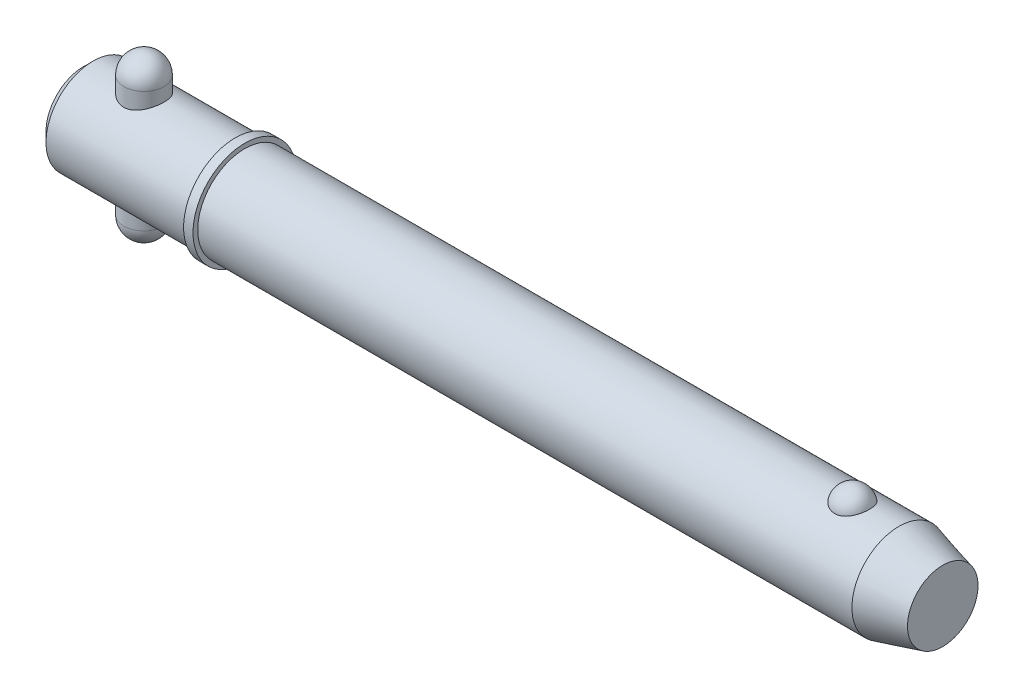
ISO-10303-21;
HEADER;
FILE_DESCRIPTION(('STEP AP214'),'2;1');
FILE_NAME('part.step','',(''),(''),'','','');
FILE_SCHEMA(('AUTOMOTIVE_DESIGN { 1 0 10303 214 1 1 1 1 }'));
ENDSEC;
DATA;
#1=APPLICATION_CONTEXT('core data for automotive mechanical design processes');
#2=APPLICATION_PROTOCOL_DEFINITION('international standard','automotive_design',2000,#1);
#3=PRODUCT_CONTEXT('',#1,'mechanical');
#4=PRODUCT('Part','Part','',(#3));
#5=PRODUCT_RELATED_PRODUCT_CATEGORY('part','',(#4));
#6=PRODUCT_DEFINITION_FORMATION('','',#4);
#7=PRODUCT_DEFINITION_CONTEXT('part definition',#1,'design');
#8=PRODUCT_DEFINITION('design','',#6,#7);
#9=PRODUCT_DEFINITION_SHAPE('','',#8);
#10=(LENGTH_UNIT() NAMED_UNIT(*) SI_UNIT(.MILLI.,.METRE.));
#11=(NAMED_UNIT(*) PLANE_ANGLE_UNIT() SI_UNIT($,.RADIAN.));
#12=(NAMED_UNIT(*) SI_UNIT($,.STERADIAN.) SOLID_ANGLE_UNIT());
#13=UNCERTAINTY_MEASURE_WITH_UNIT(LENGTH_MEASURE(1.E-05),#10,'distance_accuracy_value','');
#14=(GEOMETRIC_REPRESENTATION_CONTEXT(3) GLOBAL_UNCERTAINTY_ASSIGNED_CONTEXT((#13)) GLOBAL_UNIT_ASSIGNED_CONTEXT((#10,
#11,#12)) REPRESENTATION_CONTEXT('',''));
#15=CARTESIAN_POINT('',(0.,0.,0.));
#16=DIRECTION('',(0.,0.,1.));
#17=DIRECTION('',(1.,0.,0.));
#18=AXIS2_PLACEMENT_3D('',#15,#16,#17);
#19=CARTESIAN_POINT('',(14.28,19.05,0.));
#20=DIRECTION('',(0.,-1.,0.));
#21=DIRECTION('',(0.,0.,-1.));
#22=AXIS2_PLACEMENT_3D('',#19,#20,#21);
#23=CYLINDRICAL_SURFACE('',#22,4.76);
#24=CARTESIAN_POINT('',(14.28,-14.29,0.));
#25=DIRECTION('',(0.,-1.,0.));
#26=DIRECTION('',(0.,0.,-1.));
#27=AXIS2_PLACEMENT_3D('',#24,#25,#26);
#28=CIRCLE('',#27,4.76);
#29=CARTESIAN_POINT('',(14.28,-14.29,-4.76));
#30=VERTEX_POINT('',#29);
#31=EDGE_CURVE('P0_E10',#30,#30,#28,.F.);
#32=CARTESIAN_POINT('',(14.28,14.29,0.));
#33=DIRECTION('',(0.,-1.,0.));
#34=DIRECTION('',(0.,0.,-1.));
#35=AXIS2_PLACEMENT_3D('',#32,#33,#34);
#36=CIRCLE('',#35,4.76);
#37=CARTESIAN_POINT('',(14.28,14.29,-4.76));
#38=VERTEX_POINT('',#37);
#39=EDGE_CURVE('P0_E21',#38,#38,#36,.T.);
#40=CARTESIAN_POINT('',(14.28,-14.29,-4.76));
#41=CARTESIAN_POINT('',(14.28,-13.9922916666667,-4.76));
#42=CARTESIAN_POINT('',(14.28,-13.6945833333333,-4.76));
#43=CARTESIAN_POINT('',(14.28,-13.0991666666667,-4.76));
#44=CARTESIAN_POINT('',(14.28,-12.8014583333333,-4.76));
#45=CARTESIAN_POINT('',(14.28,-12.2060416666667,-4.76));
#46=CARTESIAN_POINT('',(14.28,-11.9083333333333,-4.76));
#47=CARTESIAN_POINT('',(14.28,-11.3129166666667,-4.76));
#48=CARTESIAN_POINT('',(14.28,-11.0152083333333,-4.76));
#49=CARTESIAN_POINT('',(14.28,-10.4197916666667,-4.76));
#50=CARTESIAN_POINT('',(14.28,-10.1220833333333,-4.76));
#51=CARTESIAN_POINT('',(14.28,-9.52666666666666,-4.76));
#52=CARTESIAN_POINT('',(14.28,-9.22895833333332,-4.76));
#53=CARTESIAN_POINT('',(14.28,-8.63354166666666,-4.76));
#54=CARTESIAN_POINT('',(14.28,-8.33583333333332,-4.76));
#55=CARTESIAN_POINT('',(14.28,-7.74041666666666,-4.76));
#56=CARTESIAN_POINT('',(14.28,-7.44270833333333,-4.76));
#57=CARTESIAN_POINT('',(14.28,-6.84729166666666,-4.76));
#58=CARTESIAN_POINT('',(14.28,-6.54958333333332,-4.76));
#59=CARTESIAN_POINT('',(14.28,-5.95416666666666,-4.76));
#60=CARTESIAN_POINT('',(14.28,-5.65645833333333,-4.76));
#61=CARTESIAN_POINT('',(14.28,-5.06104166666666,-4.76));
#62=CARTESIAN_POINT('',(14.28,-4.76333333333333,-4.76));
#63=CARTESIAN_POINT('',(14.28,-4.16791666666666,-4.76));
#64=CARTESIAN_POINT('',(14.28,-3.87020833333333,-4.76));
#65=CARTESIAN_POINT('',(14.28,-3.27479166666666,-4.76));
#66=CARTESIAN_POINT('',(14.28,-2.97708333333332,-4.76));
#67=CARTESIAN_POINT('',(14.28,-2.38166666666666,-4.76));
#68=CARTESIAN_POINT('',(14.28,-2.08395833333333,-4.76));
#69=CARTESIAN_POINT('',(14.28,-1.48854166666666,-4.76));
#70=CARTESIAN_POINT('',(14.28,-1.19083333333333,-4.76));
#71=CARTESIAN_POINT('',(14.28,-0.595416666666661,-4.76));
#72=CARTESIAN_POINT('',(14.28,-0.297708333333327,-4.76));
#73=CARTESIAN_POINT('',(14.28,0.297708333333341,-4.76));
#74=CARTESIAN_POINT('',(14.28,0.595416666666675,-4.76));
#75=CARTESIAN_POINT('',(14.28,1.19083333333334,-4.76));
#76=CARTESIAN_POINT('',(14.28,1.48854166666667,-4.76));
#77=CARTESIAN_POINT('',(14.28,2.08395833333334,-4.76));
#78=CARTESIAN_POINT('',(14.28,2.38166666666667,-4.76));
#79=CARTESIAN_POINT('',(14.28,2.97708333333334,-4.76));
#80=CARTESIAN_POINT('',(14.28,3.27479166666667,-4.76));
#81=CARTESIAN_POINT('',(14.28,3.87020833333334,-4.76));
#82=CARTESIAN_POINT('',(14.28,4.16791666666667,-4.76));
#83=CARTESIAN_POINT('',(14.28,4.76333333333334,-4.76));
#84=CARTESIAN_POINT('',(14.28,5.06104166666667,-4.76));
#85=CARTESIAN_POINT('',(14.28,5.65645833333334,-4.76));
#86=CARTESIAN_POINT('',(14.28,5.95416666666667,-4.76));
#87=CARTESIAN_POINT('',(14.28,6.54958333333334,-4.76));
#88=CARTESIAN_POINT('',(14.28,6.84729166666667,-4.76));
#89=CARTESIAN_POINT('',(14.28,7.44270833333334,-4.76));
#90=CARTESIAN_POINT('',(14.28,7.74041666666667,-4.76));
#91=CARTESIAN_POINT('',(14.28,8.33583333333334,-4.76));
#92=CARTESIAN_POINT('',(14.28,8.63354166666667,-4.76));
#93=CARTESIAN_POINT('',(14.28,9.22895833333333,-4.76));
#94=CARTESIAN_POINT('',(14.28,9.52666666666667,-4.76));
#95=CARTESIAN_POINT('',(14.28,10.1220833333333,-4.76));
#96=CARTESIAN_POINT('',(14.28,10.4197916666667,-4.76));
#97=CARTESIAN_POINT('',(14.28,11.0152083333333,-4.76));
#98=CARTESIAN_POINT('',(14.28,11.3129166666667,-4.76));
#99=CARTESIAN_POINT('',(14.28,11.9083333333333,-4.76));
#100=CARTESIAN_POINT('',(14.28,12.2060416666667,-4.76));
#101=CARTESIAN_POINT('',(14.28,12.8014583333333,-4.76));
#102=CARTESIAN_POINT('',(14.28,13.0991666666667,-4.76));
#103=CARTESIAN_POINT('',(14.28,13.6945833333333,-4.76));
#104=CARTESIAN_POINT('',(14.28,13.9922916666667,-4.76));
#105=CARTESIAN_POINT('',(14.28,14.29,-4.76));
#106=B_SPLINE_CURVE_WITH_KNOTS('',3,(#40,#41,#42,#43,#44,#45,#46,#47,#48,#49,#50,#51,#52,#53,
#54,#55,#56,#57,#58,#59,#60,#61,#62,#63,#64,#65,#66,#67,#68,#69,#70,#71,#72,#73,#74,#75,#76,#77,
#78,#79,#80,#81,#82,#83,#84,#85,#86,#87,#88,#89,#90,#91,#92,#93,#94,#95,#96,#97,#98,#99,#100,
#101,#102,#103,#104,#105),.UNSPECIFIED.,.F.,.F.,(4,2,2,2,2,2,2,2,2,2,2,2,2,2,2,2,2,2,2,2,2,2,2,
2,2,2,2,2,2,2,2,2,4),(0.,0.893125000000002,1.78625,2.67937499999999,3.5725,4.465625,5.35875,
6.25187499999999,7.145,8.038125,8.93125,9.82437499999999,10.7175,11.610625,12.50375,13.396875,
14.29,15.183125,16.07625,16.969375,17.8625,18.755625,19.64875,20.541875,21.435,22.328125,
23.22125,24.114375,25.0075,25.900625,26.79375,27.686875,28.58),.UNSPECIFIED.);
#107=EDGE_CURVE('P0_BSEAM14',#30,#38,#106,.T.);
#108=ORIENTED_EDGE('',*,*,#31,.T.);
#109=ORIENTED_EDGE('',*,*,#39,.T.);
#110=ORIENTED_EDGE('',*,*,#107,.T.);
#111=ORIENTED_EDGE('',*,*,#107,.F.);
#112=EDGE_LOOP('',(#108,#110,#109,#111));
#113=FACE_BOUND('',#112,.T.);
#114=ADVANCED_FACE('P0_F14',(#113),#23,.T.);
#115=CARTESIAN_POINT('',(14.28,-14.29,0.));
#116=DIRECTION('',(0.,0.,1.));
#117=DIRECTION('',(1.,0.,0.));
#118=AXIS2_PLACEMENT_3D('',#115,#116,#117);
#119=SPHERICAL_SURFACE('',#118,4.76);
#120=CARTESIAN_POINT('',(14.28,-14.29,0.));
#121=DIRECTION('',(0.,-1.,0.));
#122=DIRECTION('',(0.,0.,-1.));
#123=AXIS2_PLACEMENT_3D('',#120,#121,#122);
#124=SPHERICAL_SURFACE('',#123,4.76);
#125=ORIENTED_EDGE('',*,*,#31,.F.);
#126=EDGE_LOOP('',(#125));
#127=FACE_BOUND('',#126,.T.);
#128=ADVANCED_FACE('P0_F29',(#127),#124,.T.);
#129=CARTESIAN_POINT('',(14.28,14.29,0.));
#130=DIRECTION('',(0.,0.,1.));
#131=DIRECTION('',(1.,0.,0.));
#132=AXIS2_PLACEMENT_3D('',#129,#130,#131);
#133=SPHERICAL_SURFACE('',#132,4.76);
#134=CARTESIAN_POINT('',(14.28,14.29,0.));
#135=DIRECTION('',(0.,-1.,0.));
#136=DIRECTION('',(0.,0.,-1.));
#137=AXIS2_PLACEMENT_3D('',#134,#135,#136);
#138=SPHERICAL_SURFACE('',#137,4.76);
#139=ORIENTED_EDGE('',*,*,#39,.F.);
#140=EDGE_LOOP('',(#139));
#141=FACE_BOUND('',#140,.T.);
#142=ADVANCED_FACE('P0_F16',(#141),#138,.T.);
#143=CLOSED_SHELL('',(#114,#128,#142));
#144=MANIFOLD_SOLID_BREP('P0_B1',#143);
#145=CARTESIAN_POINT('',(0.,0.,0.));
#146=DIRECTION('',(1.,0.,0.));
#147=DIRECTION('',(0.,0.,-1.));
#148=AXIS2_PLACEMENT_3D('',#145,#146,#147);
#149=CYLINDRICAL_SURFACE('',#148,11.115);
#150=CARTESIAN_POINT('',(192.829563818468,0.,0.));
#151=DIRECTION('',(1.,0.,0.));
#152=DIRECTION('',(0.,0.,-1.));
#153=AXIS2_PLACEMENT_3D('',#150,#151,#152);
#154=CIRCLE('',#153,11.115);
#155=CARTESIAN_POINT('',(192.829563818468,0.,-11.115));
#156=VERTEX_POINT('',#155);
#157=EDGE_CURVE('P1_E81',#156,#156,#154,.T.);
#158=ORIENTED_EDGE('',*,*,#157,.F.);
#159=EDGE_LOOP('',(#158));
#160=FACE_BOUND('',#159,.T.);
#161=CARTESIAN_POINT('',(38.1,0.,0.));
#162=DIRECTION('',(1.,0.,0.));
#163=DIRECTION('',(0.,0.,-1.));
#164=AXIS2_PLACEMENT_3D('',#161,#162,#163);
#165=CIRCLE('',#164,11.115);
#166=CARTESIAN_POINT('',(38.1,0.,-11.115));
#167=VERTEX_POINT('',#166);
#168=EDGE_CURVE('P1_E85',#167,#167,#165,.T.);
#169=ORIENTED_EDGE('',*,*,#168,.T.);
#170=EDGE_LOOP('',(#169));
#171=FACE_BOUND('',#170,.T.);
#172=CARTESIAN_POINT('',(181.831068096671,10.3028087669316,4.17077409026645));
#173=CARTESIAN_POINT('',(181.614775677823,10.3028003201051,4.17078240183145));
#174=CARTESIAN_POINT('',(181.398548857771,10.3098895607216,4.15340593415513));
#175=CARTESIAN_POINT('',(180.972540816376,10.3373834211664,4.08449540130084));
#176=CARTESIAN_POINT('',(180.762757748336,10.3577841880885,4.03297121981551));
#177=CARTESIAN_POINT('',(180.355782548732,10.4095237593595,3.89746513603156));
#178=CARTESIAN_POINT('',(180.158572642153,10.4408466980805,3.81353029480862));
#179=CARTESIAN_POINT('',(179.781338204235,10.5110236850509,3.61560339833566));
#180=CARTESIAN_POINT('',(179.601317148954,10.5498792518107,3.50160528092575));
#181=CARTESIAN_POINT('',(179.257684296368,10.6322884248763,3.24292464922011));
#182=CARTESIAN_POINT('',(179.094686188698,10.6759443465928,3.09746040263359));
#183=CARTESIAN_POINT('',(178.794591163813,10.7625291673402,2.7817192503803));
#184=CARTESIAN_POINT('',(178.657499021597,10.8054579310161,2.61143778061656));
#185=CARTESIAN_POINT('',(178.406408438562,10.8881935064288,2.24226695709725));
#186=CARTESIAN_POINT('',(178.293710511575,10.9277761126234,2.04244123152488));
#187=CARTESIAN_POINT('',(178.101777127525,10.997484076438,1.62578254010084));
#188=CARTESIAN_POINT('',(178.022544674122,11.0276085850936,1.40894804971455));
#189=CARTESIAN_POINT('',(177.898303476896,11.0756732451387,0.961250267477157));
#190=CARTESIAN_POINT('',(177.853760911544,11.0934470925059,0.73023943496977));
#191=CARTESIAN_POINT('',(177.801569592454,11.1143331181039,0.263439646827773));
#192=CARTESIAN_POINT('',(177.793920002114,11.1174456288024,0.0276507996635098));
#193=CARTESIAN_POINT('',(177.81561056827,11.1087161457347,-0.440729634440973));
#194=CARTESIAN_POINT('',(177.844762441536,11.0969502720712,-0.673331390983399));
#195=CARTESIAN_POINT('',(177.939143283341,11.0597872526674,-1.12996621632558));
#196=CARTESIAN_POINT('',(178.004372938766,11.0343898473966,-1.35399912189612));
#197=CARTESIAN_POINT('',(178.16969844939,10.972515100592,-1.78750286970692));
#198=CARTESIAN_POINT('',(178.26983863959,10.9360236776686,-1.99695478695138));
#199=CARTESIAN_POINT('',(178.502940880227,10.8557595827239,-2.39520667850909));
#200=CARTESIAN_POINT('',(178.635905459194,10.8119863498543,-2.58400506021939));
#201=CARTESIAN_POINT('',(178.932407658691,10.7216733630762,-2.93635726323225));
#202=CARTESIAN_POINT('',(179.096056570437,10.675123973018,-3.09981510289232));
#203=CARTESIAN_POINT('',(179.449860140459,10.5846571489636,-3.39592247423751));
#204=CARTESIAN_POINT('',(179.640012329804,10.5407394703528,-3.52857487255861));
#205=CARTESIAN_POINT('',(180.03750141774,10.4616690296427,-3.75646057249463));
#206=CARTESIAN_POINT('',(180.24436705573,10.4263443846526,-3.85245432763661));
#207=CARTESIAN_POINT('',(180.672954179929,10.3675574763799,-4.00798747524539));
#208=CARTESIAN_POINT('',(180.894670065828,10.344090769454,-4.0675405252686));
#209=CARTESIAN_POINT('',(181.334669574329,10.3128282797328,-4.14614314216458));
#210=CARTESIAN_POINT('',(181.552565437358,10.3043040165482,-4.1670783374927));
#211=CARTESIAN_POINT('',(181.98894951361,10.3016771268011,-4.17357158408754));
#212=CARTESIAN_POINT('',(182.207437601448,10.3075716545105,-4.15913661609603));
#213=CARTESIAN_POINT('',(182.631744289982,10.3326686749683,-4.09636961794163));
#214=CARTESIAN_POINT('',(182.837745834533,10.3514555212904,-4.0490957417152));
#215=CARTESIAN_POINT('',(183.238576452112,10.399818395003,-3.92320197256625));
#216=CARTESIAN_POINT('',(183.4334046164,10.4293952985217,-3.84457953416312));
#217=CARTESIAN_POINT('',(183.811191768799,10.4969600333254,-3.65612410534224));
#218=CARTESIAN_POINT('',(183.993797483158,10.5351178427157,-3.54564545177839));
#219=CARTESIAN_POINT('',(184.338204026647,10.6154999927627,-3.29718036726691));
#220=CARTESIAN_POINT('',(184.500000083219,10.657725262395,-3.15918764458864));
#221=CARTESIAN_POINT('',(184.806959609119,10.744212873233,-2.85163580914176));
#222=CARTESIAN_POINT('',(184.950891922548,10.7884718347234,-2.68084605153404));
#223=CARTESIAN_POINT('',(185.209237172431,10.872374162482,-2.31721864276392));
#224=CARTESIAN_POINT('',(185.323644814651,10.9120167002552,-2.12437704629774));
#225=CARTESIAN_POINT('',(185.523873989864,10.9838919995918,-1.71516999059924));
#226=CARTESIAN_POINT('',(185.60866178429,11.0158465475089,-1.49824866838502));
#227=CARTESIAN_POINT('',(185.74268382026,11.0673523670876,-1.05228572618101));
#228=CARTESIAN_POINT('',(185.791917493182,11.086903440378,-0.823243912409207));
#229=CARTESIAN_POINT('',(185.853891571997,11.1116323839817,-0.359087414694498));
#230=CARTESIAN_POINT('',(185.866566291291,11.1167843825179,-0.12396256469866));
#231=CARTESIAN_POINT('',(185.854973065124,11.1121144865,0.345220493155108));
#232=CARTESIAN_POINT('',(185.830705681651,11.1022928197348,0.579278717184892));
#233=CARTESIAN_POINT('',(185.745907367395,11.0687504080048,1.03866534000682));
#234=CARTESIAN_POINT('',(185.685529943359,11.0450885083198,1.26402641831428));
#235=CARTESIAN_POINT('',(185.529853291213,10.9863185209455,1.70076772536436));
#236=CARTESIAN_POINT('',(185.434551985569,10.9512097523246,1.91214712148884));
#237=CARTESIAN_POINT('',(185.210397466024,10.8729733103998,2.316083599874));
#238=CARTESIAN_POINT('',(185.081380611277,10.8298068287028,2.50854240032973));
#239=CARTESIAN_POINT('',(184.792732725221,10.7401896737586,2.86808766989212));
#240=CARTESIAN_POINT('',(184.633102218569,10.6937390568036,3.03517457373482));
#241=CARTESIAN_POINT('',(184.287534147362,10.6029321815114,3.33857581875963));
#242=CARTESIAN_POINT('',(184.101708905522,10.5585680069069,3.47501541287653));
#243=CARTESIAN_POINT('',(183.707875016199,10.4769321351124,3.71390897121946));
#244=CARTESIAN_POINT('',(183.499863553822,10.439661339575,3.81635861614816));
#245=CARTESIAN_POINT('',(183.054066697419,10.3749407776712,3.98910631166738));
#246=CARTESIAN_POINT('',(182.815234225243,10.3482457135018,4.05700929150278));
#247=CARTESIAN_POINT('',(182.327925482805,10.312188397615,4.14782844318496));
#248=CARTESIAN_POINT('',(182.079453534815,10.3028184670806,4.17076454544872));
#249=CARTESIAN_POINT('',(181.831068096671,10.3028087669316,4.17077409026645));
#250=B_SPLINE_CURVE_WITH_KNOTS('',3,(#172,#173,#174,#175,#176,#177,#178,#179,#180,#181,#182,
#183,#184,#185,#186,#187,#188,#189,#190,#191,#192,#193,#194,#195,#196,#197,#198,#199,#200,#201,
#202,#203,#204,#205,#206,#207,#208,#209,#210,#211,#212,#213,#214,#215,#216,#217,#218,#219,#220,
#221,#222,#223,#224,#225,#226,#227,#228,#229,#230,#231,#232,#233,#234,#235,#236,#237,#238,#239,
#240,#241,#242,#243,#244,#245,#246,#247,#248,#249),.UNSPECIFIED.,.T.,.F.,(4,2,2,2,2,2,2,2,2,2,2,
2,2,2,2,2,2,2,2,2,2,2,2,2,2,2,2,2,2,2,2,2,2,2,2,2,2,2,4),(0.,0.647966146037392,1.29574482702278,
1.9425864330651,2.58955857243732,3.25496465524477,3.92049326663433,4.61566368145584,
5.31089647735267,6.01531821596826,6.71972398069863,7.42054043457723,8.12137023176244,
8.82309331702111,9.5248704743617,10.2292439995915,10.9335519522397,11.6223330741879,
12.3108558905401,12.9647664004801,13.6185478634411,14.252184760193,14.8858731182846,
15.5334360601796,16.1811472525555,16.8611459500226,17.5412664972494,18.2431855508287,
18.9451158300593,19.6483065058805,20.3514864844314,21.0516982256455,21.7519516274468,
22.4556690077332,23.1593743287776,23.8601491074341,24.5610129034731,25.3054529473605,
26.049562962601),.UNSPECIFIED.);
#251=CARTESIAN_POINT('',(181.831068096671,10.3028087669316,4.17077409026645));
#252=VERTEX_POINT('',#251);
#253=EDGE_CURVE('P1_E35',#252,#252,#250,.T.);
#254=ORIENTED_EDGE('',*,*,#253,.T.);
#255=EDGE_LOOP('',(#254));
#256=FACE_BOUND('',#255,.T.);
#257=ADVANCED_FACE('P1_F13',(#160,#171,#256),#149,.T.);
#258=CARTESIAN_POINT('',(0.,0.,0.));
#259=DIRECTION('',(-1.,0.,0.));
#260=DIRECTION('',(0.,0.,1.));
#261=AXIS2_PLACEMENT_3D('',#258,#259,#260);
#262=PLANE('',#261);
#263=CARTESIAN_POINT('',(0.,0.,0.));
#264=DIRECTION('',(1.,0.,0.));
#265=DIRECTION('',(0.,0.,-1.));
#266=AXIS2_PLACEMENT_3D('',#263,#264,#265);
#267=CIRCLE('',#266,8.892);
#268=CARTESIAN_POINT('',(0.,0.,-8.892));
#269=VERTEX_POINT('',#268);
#270=EDGE_CURVE('P1_E9',#269,#269,#267,.T.);
#271=ORIENTED_EDGE('',*,*,#270,.F.);
#272=EDGE_LOOP('',(#271));
#273=FACE_BOUND('',#272,.T.);
#274=ADVANCED_FACE('P1_F15',(#273),#262,.T.);
#275=CARTESIAN_POINT('',(2.22299999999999,0.,0.));
#276=DIRECTION('',(1.,0.,0.));
#277=DIRECTION('',(0.,0.,-1.));
#278=AXIS2_PLACEMENT_3D('',#275,#276,#277);
#279=CONICAL_SURFACE('',#278,11.115,0.78539816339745);
#280=ORIENTED_EDGE('',*,*,#270,.T.);
#281=EDGE_LOOP('',(#280));
#282=FACE_BOUND('',#281,.T.);
#283=CARTESIAN_POINT('',(2.22299999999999,0.,0.));
#284=DIRECTION('',(1.,0.,0.));
#285=DIRECTION('',(0.,0.,-1.));
#286=AXIS2_PLACEMENT_3D('',#283,#284,#285);
#287=CIRCLE('',#286,11.115);
#288=CARTESIAN_POINT('',(2.22299999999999,0.,-11.115));
#289=VERTEX_POINT('',#288);
#290=EDGE_CURVE('P1_E26',#289,#289,#287,.T.);
#291=ORIENTED_EDGE('',*,*,#290,.F.);
#292=EDGE_LOOP('',(#291));
#293=FACE_BOUND('',#292,.T.);
#294=ADVANCED_FACE('P1_F77',(#282,#293),#279,.T.);
#295=CARTESIAN_POINT('',(0.,0.,0.));
#296=DIRECTION('',(1.,0.,0.));
#297=DIRECTION('',(0.,0.,-1.));
#298=AXIS2_PLACEMENT_3D('',#295,#296,#297);
#299=CYLINDRICAL_SURFACE('',#298,11.115);
#300=CARTESIAN_POINT('',(14.28,-10.0441836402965,4.76));
#301=CARTESIAN_POINT('',(14.1533731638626,-10.0441846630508,4.75999904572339));
#302=CARTESIAN_POINT('',(14.0267055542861,-10.0465865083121,4.75493985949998));
#303=CARTESIAN_POINT('',(13.774298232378,-10.0561141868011,4.73475585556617));
#304=CARTESIAN_POINT('',(13.6485591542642,-10.0632429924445,4.71962470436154));
#305=CARTESIAN_POINT('',(13.3987500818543,-10.0819979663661,4.67942666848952));
#306=CARTESIAN_POINT('',(13.2746840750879,-10.0936334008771,4.65433930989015));
#307=CARTESIAN_POINT('',(13.0293244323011,-10.1210146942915,4.59449317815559));
#308=CARTESIAN_POINT('',(12.9080319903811,-10.1367622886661,4.55973032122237));
#309=CARTESIAN_POINT('',(12.669614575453,-10.1717810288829,4.48106435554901));
#310=CARTESIAN_POINT('',(12.5524727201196,-10.1910352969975,4.4372048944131));
#311=CARTESIAN_POINT('',(12.3224300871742,-10.2325403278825,4.34063417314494));
#312=CARTESIAN_POINT('',(12.2095309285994,-10.2547922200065,4.28791957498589));
#313=CARTESIAN_POINT('',(11.8782785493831,-10.3250879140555,4.11715127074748));
#314=CARTESIAN_POINT('',(11.6670799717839,-10.3767168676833,3.98637638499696));
#315=CARTESIAN_POINT('',(11.2564039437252,-10.4874309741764,3.68567149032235));
#316=CARTESIAN_POINT('',(11.0583793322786,-10.5467772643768,3.51386978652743));
#317=CARTESIAN_POINT('',(10.6927724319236,-10.6641377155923,3.13969960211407));
#318=CARTESIAN_POINT('',(10.5252022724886,-10.7221513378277,2.93731900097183));
#319=CARTESIAN_POINT('',(10.2965609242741,-10.8050020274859,2.60935726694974));
#320=CARTESIAN_POINT('',(10.2227768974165,-10.8324811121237,2.49310321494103));
#321=CARTESIAN_POINT('',(10.0853380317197,-10.884703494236,2.25418999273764));
#322=CARTESIAN_POINT('',(10.0216789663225,-10.9094479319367,2.13153352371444));
#323=CARTESIAN_POINT('',(9.90506238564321,-10.9554932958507,1.88060370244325));
#324=CARTESIAN_POINT('',(9.85210574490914,-10.9767939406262,1.7523298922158));
#325=CARTESIAN_POINT('',(9.75746464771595,-11.0153112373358,1.49115740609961));
#326=CARTESIAN_POINT('',(9.71577447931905,-11.0325299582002,1.35826111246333));
#327=CARTESIAN_POINT('',(9.64605475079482,-11.0615607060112,1.09614539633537));
#328=CARTESIAN_POINT('',(9.61740732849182,-11.0736151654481,0.96711700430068));
#329=CARTESIAN_POINT('',(9.57092026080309,-11.0932687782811,0.706847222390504));
#330=CARTESIAN_POINT('',(9.55307574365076,-11.1008699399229,0.575606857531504));
#331=CARTESIAN_POINT('',(9.52838640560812,-11.1114054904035,0.31192917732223));
#332=CARTESIAN_POINT('',(9.52153986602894,-11.114340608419,0.179492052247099));
#333=CARTESIAN_POINT('',(9.51892405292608,-11.1154607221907,-0.0855090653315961));
#334=CARTESIAN_POINT('',(9.52315432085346,-11.1136459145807,-0.218073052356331));
#335=CARTESIAN_POINT('',(9.542009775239,-11.1055891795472,-0.473709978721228));
#336=CARTESIAN_POINT('',(9.55594693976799,-11.099640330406,-0.596843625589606));
#337=CARTESIAN_POINT('',(9.59332832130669,-11.0837823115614,-0.841440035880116));
#338=CARTESIAN_POINT('',(9.61677567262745,-11.0738718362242,-0.962902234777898));
#339=CARTESIAN_POINT('',(9.67294089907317,-11.0503378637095,-1.20325684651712));
#340=CARTESIAN_POINT('',(9.70565569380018,-11.0367156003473,-1.32215009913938));
#341=CARTESIAN_POINT('',(9.78005008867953,-11.0060908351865,-1.55666640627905));
#342=CARTESIAN_POINT('',(9.82173311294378,-10.9890870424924,-1.67228819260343));
#343=CARTESIAN_POINT('',(9.96110379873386,-10.9330280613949,-2.01656166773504));
#344=CARTESIAN_POINT('',(10.0722987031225,-10.8892801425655,-2.23915547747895));
#345=CARTESIAN_POINT('',(10.3268588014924,-10.7934745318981,-2.66299199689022));
#346=CARTESIAN_POINT('',(10.4702355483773,-10.7414138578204,-2.86422700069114));
#347=CARTESIAN_POINT('',(10.7973904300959,-10.6296201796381,-3.25557775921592));
#348=CARTESIAN_POINT('',(10.9833705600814,-10.569604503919,-3.443774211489));
#349=CARTESIAN_POINT('',(11.3844486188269,-10.4514707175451,-3.78722133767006));
#350=CARTESIAN_POINT('',(11.5995590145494,-10.3933534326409,-3.94245783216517));
#351=CARTESIAN_POINT('',(11.9444340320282,-10.311516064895,-4.14990014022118));
#352=CARTESIAN_POINT('',(12.0654579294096,-10.2847012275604,-4.21573894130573));
#353=CARTESIAN_POINT('',(12.3132718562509,-10.2342051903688,-4.33688518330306));
#354=CARTESIAN_POINT('',(12.4400593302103,-10.2105226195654,-4.39219723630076));
#355=CARTESIAN_POINT('',(12.6985418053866,-10.1671237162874,-4.49174500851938));
#356=CARTESIAN_POINT('',(12.8302359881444,-10.1474067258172,-4.53598256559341));
#357=CARTESIAN_POINT('',(13.0975061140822,-10.1126841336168,-4.61287629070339));
#358=CARTESIAN_POINT('',(13.233079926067,-10.0976759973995,-4.64553869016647));
#359=CARTESIAN_POINT('',(13.4978553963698,-10.0737863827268,-4.6971059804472));
#360=CARTESIAN_POINT('',(13.6268754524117,-10.0645618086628,-4.716785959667));
#361=CARTESIAN_POINT('',(13.8862990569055,-10.051062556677,-4.74548419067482));
#362=CARTESIAN_POINT('',(14.0167019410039,-10.0467856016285,-4.75450734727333));
#363=CARTESIAN_POINT('',(14.277859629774,-10.0433352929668,-4.76179143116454));
#364=CARTESIAN_POINT('',(14.4086143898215,-10.0441613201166,-4.76005366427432));
#365=CARTESIAN_POINT('',(14.6694025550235,-10.0508838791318,-4.74584231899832));
#366=CARTESIAN_POINT('',(14.7994359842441,-10.0567802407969,-4.73336910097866));
#367=CARTESIAN_POINT('',(15.0487369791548,-10.0728449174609,-4.69907984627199));
#368=CARTESIAN_POINT('',(15.1681238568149,-10.0826872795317,-4.67797462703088));
#369=CARTESIAN_POINT('',(15.4045894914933,-10.1062580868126,-4.62682977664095));
#370=CARTESIAN_POINT('',(15.5216674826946,-10.1199877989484,-4.59678723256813));
#371=CARTESIAN_POINT('',(15.868278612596,-10.1664161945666,-4.49365911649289));
#372=CARTESIAN_POINT('',(16.0933756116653,-10.2043671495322,-4.40754694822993));
#373=CARTESIAN_POINT('',(16.5357981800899,-10.2919879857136,-4.19898201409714));
#374=CARTESIAN_POINT('',(16.7523611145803,-10.3420954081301,-4.07511281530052));
#375=CARTESIAN_POINT('',(17.1627188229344,-10.4477911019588,-3.7959429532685));
#376=CARTESIAN_POINT('',(17.3565033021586,-10.5033818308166,-3.64062816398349));
#377=CARTESIAN_POINT('',(17.7334034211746,-10.6196376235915,-3.28693729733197));
#378=CARTESIAN_POINT('',(17.9141276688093,-10.6803237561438,-3.08599175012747));
#379=CARTESIAN_POINT('',(18.1582189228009,-10.7666348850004,-2.76320365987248));
#380=CARTESIAN_POINT('',(18.2351223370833,-10.7946346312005,-2.65197124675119));
#381=CARTESIAN_POINT('',(18.3793967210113,-10.8483267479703,-2.42297927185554));
#382=CARTESIAN_POINT('',(18.4467718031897,-10.87402011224,-2.30522255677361));
#383=CARTESIAN_POINT('',(18.5717669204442,-10.9225249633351,-2.06324665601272));
#384=CARTESIAN_POINT('',(18.6293326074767,-10.9453202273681,-1.93899615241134));
#385=CARTESIAN_POINT('',(18.73370006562,-10.9872100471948,-1.6855059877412));
#386=CARTESIAN_POINT('',(18.7805065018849,-11.0063062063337,-1.55626851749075));
#387=CARTESIAN_POINT('',(18.8628731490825,-11.0402419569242,-1.29375150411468));
#388=CARTESIAN_POINT('',(18.8984366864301,-11.0550828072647,-1.16047316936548));
#389=CARTESIAN_POINT('',(18.9579183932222,-11.0800638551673,-0.890912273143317));
#390=CARTESIAN_POINT('',(18.9818374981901,-11.0902044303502,-0.75462995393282));
#391=CARTESIAN_POINT('',(19.0164177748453,-11.104911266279,-0.490295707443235));
#392=CARTESIAN_POINT('',(19.027922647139,-11.1098318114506,-0.362373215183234));
#393=CARTESIAN_POINT('',(19.040554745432,-11.1152360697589,-0.105876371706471));
#394=CARTESIAN_POINT('',(19.0416784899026,-11.1157182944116,0.0226981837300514));
#395=CARTESIAN_POINT('',(19.0335275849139,-11.1122291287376,0.27938352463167));
#396=CARTESIAN_POINT('',(19.0242587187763,-11.1082602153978,0.407494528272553));
#397=CARTESIAN_POINT('',(18.9954320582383,-11.0959792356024,0.662388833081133));
#398=CARTESIAN_POINT('',(18.9758704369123,-11.0876655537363,0.789171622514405));
#399=CARTESIAN_POINT('',(18.9276379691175,-11.0673259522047,1.03545890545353));
#400=CARTESIAN_POINT('',(18.8993573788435,-11.0554596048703,1.15505309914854));
#401=CARTESIAN_POINT('',(18.8337694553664,-11.0282166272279,1.39134516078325));
#402=CARTESIAN_POINT('',(18.7964589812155,-11.0128387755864,1.5080420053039));
#403=CARTESIAN_POINT('',(18.671464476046,-10.9619666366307,1.85262797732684));
#404=CARTESIAN_POINT('',(18.5706772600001,-10.9217161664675,2.07521484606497));
#405=CARTESIAN_POINT('',(18.33202463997,-10.8301378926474,2.51061719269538));
#406=CARTESIAN_POINT('',(18.1926775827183,-10.7783885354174,2.72252375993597));
#407=CARTESIAN_POINT('',(17.8829747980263,-10.669863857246,3.12088015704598));
#408=CARTESIAN_POINT('',(17.7126068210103,-10.6130865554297,3.30731987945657));
#409=CARTESIAN_POINT('',(17.3310036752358,-10.495668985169,3.66358491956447));
#410=CARTESIAN_POINT('',(17.1177010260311,-10.4350471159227,3.83122543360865));
#411=CARTESIAN_POINT('',(16.7778915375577,-10.3495418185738,4.05420569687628));
#412=CARTESIAN_POINT('',(16.6612023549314,-10.3219229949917,4.12383380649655));
#413=CARTESIAN_POINT('',(16.4218466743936,-10.2693487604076,4.25306463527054));
#414=CARTESIAN_POINT('',(16.2991829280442,-10.2443921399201,4.31267191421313));
#415=CARTESIAN_POINT('',(16.0488008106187,-10.1979981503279,4.42126071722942));
#416=CARTESIAN_POINT('',(15.9210894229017,-10.1765561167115,4.47025635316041));
#417=CARTESIAN_POINT('',(15.6613937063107,-10.1379191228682,4.55720152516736));
#418=CARTESIAN_POINT('',(15.5294115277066,-10.1207220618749,4.59515652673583));
#419=CARTESIAN_POINT('',(15.2624981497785,-10.091252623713,4.65951684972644));
#420=CARTESIAN_POINT('',(15.1275757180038,-10.0789672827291,4.68595259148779));
#421=CARTESIAN_POINT('',(14.8556442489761,-10.0597530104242,4.72706206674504));
#422=CARTESIAN_POINT('',(14.7186368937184,-10.0528199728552,4.74174481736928));
#423=CARTESIAN_POINT('',(14.5310955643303,-10.047196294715,4.75363843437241));
#424=CARTESIAN_POINT('',(14.48091543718,-10.0460674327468,4.75602323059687));
#425=CARTESIAN_POINT('',(14.3804923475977,-10.044560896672,4.7592042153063));
#426=CARTESIAN_POINT('',(14.3302493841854,-10.0441832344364,4.76000037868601));
#427=CARTESIAN_POINT('',(14.28,-10.0441836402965,4.76));
#428=B_SPLINE_CURVE_WITH_KNOTS('',3,(#300,#301,#302,#303,#304,#305,#306,#307,#308,#309,#310,
#311,#312,#313,#314,#315,#316,#317,#318,#319,#320,#321,#322,#323,#324,#325,#326,#327,#328,#329,
#330,#331,#332,#333,#334,#335,#336,#337,#338,#339,#340,#341,#342,#343,#344,#345,#346,#347,#348,
#349,#350,#351,#352,#353,#354,#355,#356,#357,#358,#359,#360,#361,#362,#363,#364,#365,#366,#367,
#368,#369,#370,#371,#372,#373,#374,#375,#376,#377,#378,#379,#380,#381,#382,#383,#384,#385,#386,
#387,#388,#389,#390,#391,#392,#393,#394,#395,#396,#397,#398,#399,#400,#401,#402,#403,#404,#405,
#406,#407,#408,#409,#410,#411,#412,#413,#414,#415,#416,#417,#418,#419,#420,#421,#422,#423,#424,
#425,#426,#427),.UNSPECIFIED.,.T.,.F.,(4,2,2,2,2,2,2,2,2,2,2,2,2,2,2,2,2,2,2,2,2,2,2,2,2,2,2,2,
2,2,2,2,2,2,2,2,2,2,2,2,2,2,2,2,2,2,2,2,2,2,2,2,2,2,2,2,2,2,2,2,2,2,2,4),(0.,0.379828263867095,
0.759895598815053,1.14074858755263,1.52176256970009,1.90098898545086,2.28035867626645,
3.03818035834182,3.84125131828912,4.6446414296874,5.06541657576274,5.48601561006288,
5.90664899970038,6.3270687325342,6.72470503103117,7.12216187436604,7.51955659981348,
7.91693487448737,8.28868404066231,8.66055582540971,9.03230414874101,9.40419465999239,
10.1585834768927,10.9132435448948,11.7236471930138,12.5343987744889,12.9550196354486,
13.3754557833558,13.7958221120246,14.2159617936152,14.6079540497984,14.9997658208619,
15.3915300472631,15.7832811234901,16.1477615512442,16.512360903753,17.240999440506,
18.0012974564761,18.761937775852,19.5886929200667,20.0025782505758,20.4162843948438,
20.832212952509,21.2479608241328,21.6635855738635,22.0791769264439,22.4642880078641,
22.8495282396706,23.2345541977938,23.6197234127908,23.9896813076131,24.3597680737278,
25.099327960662,25.8726239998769,26.6462260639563,27.4759193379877,27.8914891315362,
28.3068693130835,28.7216936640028,29.1363123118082,29.5498292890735,29.9630287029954,
30.113753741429,30.2644811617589),.UNSPECIFIED.);
#429=CARTESIAN_POINT('',(14.28,-10.0441836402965,4.76));
#430=VERTEX_POINT('',#429);
#431=EDGE_CURVE('P1_E17',#430,#430,#428,.T.);
#432=ORIENTED_EDGE('',*,*,#431,.F.);
#433=EDGE_LOOP('',(#432));
#434=FACE_BOUND('',#433,.T.);
#435=CARTESIAN_POINT('',(14.28,10.0441836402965,4.76));
#436=CARTESIAN_POINT('',(14.4066268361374,10.0441846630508,4.75999904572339));
#437=CARTESIAN_POINT('',(14.5332944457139,10.0465865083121,4.75493985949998));
#438=CARTESIAN_POINT('',(14.785701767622,10.0561141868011,4.73475585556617));
#439=CARTESIAN_POINT('',(14.9114408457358,10.0632429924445,4.71962470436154));
#440=CARTESIAN_POINT('',(15.1612499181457,10.0819979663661,4.67942666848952));
#441=CARTESIAN_POINT('',(15.2853159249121,10.0936334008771,4.65433930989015));
#442=CARTESIAN_POINT('',(15.5306755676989,10.1210146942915,4.59449317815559));
#443=CARTESIAN_POINT('',(15.6519680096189,10.1367622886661,4.55973032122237));
#444=CARTESIAN_POINT('',(15.890385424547,10.1717810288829,4.48106435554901));
#445=CARTESIAN_POINT('',(16.0075272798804,10.1910352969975,4.4372048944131));
#446=CARTESIAN_POINT('',(16.2375699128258,10.2325403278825,4.34063417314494));
#447=CARTESIAN_POINT('',(16.3504690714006,10.2547922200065,4.28791957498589));
#448=CARTESIAN_POINT('',(16.6817214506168,10.3250879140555,4.11715127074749));
#449=CARTESIAN_POINT('',(16.8929200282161,10.3767168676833,3.98637638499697));
#450=CARTESIAN_POINT('',(17.3035960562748,10.4874309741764,3.68567149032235));
#451=CARTESIAN_POINT('',(17.5016206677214,10.5467772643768,3.51386978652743));
#452=CARTESIAN_POINT('',(17.8672275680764,10.6641377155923,3.13969960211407));
#453=CARTESIAN_POINT('',(18.0347977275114,10.7221513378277,2.93731900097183));
#454=CARTESIAN_POINT('',(18.2634390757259,10.8050020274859,2.60935726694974));
#455=CARTESIAN_POINT('',(18.3372231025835,10.8324811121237,2.49310321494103));
#456=CARTESIAN_POINT('',(18.4746619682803,10.884703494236,2.25418999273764));
#457=CARTESIAN_POINT('',(18.5383210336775,10.9094479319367,2.13153352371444));
#458=CARTESIAN_POINT('',(18.6549376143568,10.9554932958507,1.88060370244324));
#459=CARTESIAN_POINT('',(18.7078942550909,10.9767939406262,1.75232989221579));
#460=CARTESIAN_POINT('',(18.8025353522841,11.0153112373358,1.4911574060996));
#461=CARTESIAN_POINT('',(18.844225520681,11.0325299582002,1.35826111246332));
#462=CARTESIAN_POINT('',(18.9139452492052,11.0615607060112,1.09614539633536));
#463=CARTESIAN_POINT('',(18.9425926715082,11.0736151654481,0.967117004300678));
#464=CARTESIAN_POINT('',(18.9890797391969,11.0932687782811,0.706847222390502));
#465=CARTESIAN_POINT('',(19.0069242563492,11.1008699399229,0.575606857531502));
#466=CARTESIAN_POINT('',(19.0316135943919,11.1114054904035,0.311929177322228));
#467=CARTESIAN_POINT('',(19.0384601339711,11.114340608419,0.179492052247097));
#468=CARTESIAN_POINT('',(19.0410759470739,11.1154607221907,-0.0855090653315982));
#469=CARTESIAN_POINT('',(19.0368456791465,11.1136459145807,-0.218073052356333));
#470=CARTESIAN_POINT('',(19.017990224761,11.1055891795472,-0.47370997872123));
#471=CARTESIAN_POINT('',(19.004053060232,11.099640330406,-0.596843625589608));
#472=CARTESIAN_POINT('',(18.9666716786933,11.0837823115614,-0.841440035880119));
#473=CARTESIAN_POINT('',(18.9432243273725,11.0738718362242,-0.9629022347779));
#474=CARTESIAN_POINT('',(18.8870591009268,11.0503378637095,-1.20325684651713));
#475=CARTESIAN_POINT('',(18.8543443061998,11.0367156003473,-1.32215009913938));
#476=CARTESIAN_POINT('',(18.7799499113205,11.0060908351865,-1.55666640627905));
#477=CARTESIAN_POINT('',(18.7382668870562,10.9890870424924,-1.67228819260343));
#478=CARTESIAN_POINT('',(18.5988962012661,10.9330280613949,-2.01656166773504));
#479=CARTESIAN_POINT('',(18.4877012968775,10.8892801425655,-2.23915547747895));
#480=CARTESIAN_POINT('',(18.2331411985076,10.7934745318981,-2.66299199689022));
#481=CARTESIAN_POINT('',(18.0897644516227,10.7414138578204,-2.86422700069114));
#482=CARTESIAN_POINT('',(17.7626095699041,10.6296201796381,-3.25557775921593));
#483=CARTESIAN_POINT('',(17.5766294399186,10.569604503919,-3.443774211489));
#484=CARTESIAN_POINT('',(17.1755513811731,10.4514707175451,-3.78722133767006));
#485=CARTESIAN_POINT('',(16.9604409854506,10.3933534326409,-3.94245783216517));
#486=CARTESIAN_POINT('',(16.6155659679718,10.311516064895,-4.14990014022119));
#487=CARTESIAN_POINT('',(16.4945420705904,10.2847012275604,-4.21573894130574));
#488=CARTESIAN_POINT('',(16.2467281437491,10.2342051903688,-4.33688518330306));
#489=CARTESIAN_POINT('',(16.1199406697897,10.2105226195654,-4.39219723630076));
#490=CARTESIAN_POINT('',(15.8614581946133,10.1671237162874,-4.49174500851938));
#491=CARTESIAN_POINT('',(15.7297640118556,10.1474067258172,-4.53598256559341));
#492=CARTESIAN_POINT('',(15.4624938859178,10.1126841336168,-4.61287629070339));
#493=CARTESIAN_POINT('',(15.326920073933,10.0976759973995,-4.64553869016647));
#494=CARTESIAN_POINT('',(15.0621446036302,10.0737863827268,-4.6971059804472));
#495=CARTESIAN_POINT('',(14.9331245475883,10.0645618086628,-4.716785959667));
#496=CARTESIAN_POINT('',(14.6737009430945,10.051062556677,-4.74548419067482));
#497=CARTESIAN_POINT('',(14.543298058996,10.0467856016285,-4.75450734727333));
#498=CARTESIAN_POINT('',(14.2821403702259,10.0433352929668,-4.76179143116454));
#499=CARTESIAN_POINT('',(14.1513856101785,10.0441613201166,-4.76005366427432));
#500=CARTESIAN_POINT('',(13.8905974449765,10.0508838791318,-4.74584231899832));
#501=CARTESIAN_POINT('',(13.7605640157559,10.0567802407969,-4.73336910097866));
#502=CARTESIAN_POINT('',(13.5112630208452,10.0728449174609,-4.69907984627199));
#503=CARTESIAN_POINT('',(13.3918761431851,10.0826872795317,-4.67797462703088));
#504=CARTESIAN_POINT('',(13.1554105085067,10.1062580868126,-4.62682977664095));
#505=CARTESIAN_POINT('',(13.0383325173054,10.1199877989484,-4.59678723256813));
#506=CARTESIAN_POINT('',(12.691721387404,10.1664161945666,-4.49365911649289));
#507=CARTESIAN_POINT('',(12.4666243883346,10.2043671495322,-4.40754694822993));
#508=CARTESIAN_POINT('',(12.0242018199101,10.2919879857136,-4.19898201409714));
#509=CARTESIAN_POINT('',(11.8076388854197,10.3420954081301,-4.07511281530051));
#510=CARTESIAN_POINT('',(11.3972811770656,10.4477911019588,-3.7959429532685));
#511=CARTESIAN_POINT('',(11.2034966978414,10.5033818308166,-3.64062816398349));
#512=CARTESIAN_POINT('',(10.8265965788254,10.6196376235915,-3.28693729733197));
#513=CARTESIAN_POINT('',(10.6458723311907,10.6803237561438,-3.08599175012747));
#514=CARTESIAN_POINT('',(10.4017810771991,10.7666348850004,-2.76320365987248));
#515=CARTESIAN_POINT('',(10.3248776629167,10.7946346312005,-2.65197124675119));
#516=CARTESIAN_POINT('',(10.1806032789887,10.8483267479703,-2.42297927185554));
#517=CARTESIAN_POINT('',(10.1132281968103,10.87402011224,-2.30522255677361));
#518=CARTESIAN_POINT('',(9.98823307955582,10.9225249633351,-2.06324665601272));
#519=CARTESIAN_POINT('',(9.93066739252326,10.9453202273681,-1.93899615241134));
#520=CARTESIAN_POINT('',(9.82629993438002,10.9872100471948,-1.6855059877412));
#521=CARTESIAN_POINT('',(9.77949349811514,11.0063062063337,-1.55626851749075));
#522=CARTESIAN_POINT('',(9.69712685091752,11.0402419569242,-1.29375150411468));
#523=CARTESIAN_POINT('',(9.66156331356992,11.0550828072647,-1.16047316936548));
#524=CARTESIAN_POINT('',(9.60208160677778,11.0800638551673,-0.890912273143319));
#525=CARTESIAN_POINT('',(9.57816250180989,11.0902044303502,-0.754629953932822));
#526=CARTESIAN_POINT('',(9.54358222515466,11.104911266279,-0.490295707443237));
#527=CARTESIAN_POINT('',(9.53207735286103,11.1098318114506,-0.362373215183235));
#528=CARTESIAN_POINT('',(9.51944525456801,11.1152360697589,-0.105876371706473));
#529=CARTESIAN_POINT('',(9.51832151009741,11.1157182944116,0.0226981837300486));
#530=CARTESIAN_POINT('',(9.52647241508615,11.1122291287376,0.279383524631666));
#531=CARTESIAN_POINT('',(9.53574128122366,11.1082602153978,0.407494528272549));
#532=CARTESIAN_POINT('',(9.5645679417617,11.0959792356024,0.662388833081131));
#533=CARTESIAN_POINT('',(9.58412956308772,11.0876655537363,0.789171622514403));
#534=CARTESIAN_POINT('',(9.63236203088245,11.0673259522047,1.03545890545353));
#535=CARTESIAN_POINT('',(9.66064262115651,11.0554596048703,1.15505309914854));
#536=CARTESIAN_POINT('',(9.72623054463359,11.0282166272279,1.39134516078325));
#537=CARTESIAN_POINT('',(9.76354101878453,11.0128387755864,1.5080420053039));
#538=CARTESIAN_POINT('',(9.88853552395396,10.9619666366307,1.85262797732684));
#539=CARTESIAN_POINT('',(9.98932273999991,10.9217161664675,2.07521484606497));
#540=CARTESIAN_POINT('',(10.22797536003,10.8301378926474,2.51061719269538));
#541=CARTESIAN_POINT('',(10.3673224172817,10.7783885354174,2.72252375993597));
#542=CARTESIAN_POINT('',(10.6770252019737,10.669863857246,3.12088015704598));
#543=CARTESIAN_POINT('',(10.8473931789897,10.6130865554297,3.30731987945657));
#544=CARTESIAN_POINT('',(11.2289963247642,10.495668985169,3.66358491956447));
#545=CARTESIAN_POINT('',(11.4422989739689,10.4350471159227,3.83122543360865));
#546=CARTESIAN_POINT('',(11.7821084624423,10.3495418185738,4.05420569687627));
#547=CARTESIAN_POINT('',(11.8987976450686,10.3219229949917,4.12383380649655));
#548=CARTESIAN_POINT('',(12.1381533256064,10.2693487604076,4.25306463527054));
#549=CARTESIAN_POINT('',(12.2608170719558,10.2443921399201,4.31267191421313));
#550=CARTESIAN_POINT('',(12.5111991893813,10.1979981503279,4.42126071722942));
#551=CARTESIAN_POINT('',(12.6389105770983,10.1765561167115,4.47025635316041));
#552=CARTESIAN_POINT('',(12.8986062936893,10.1379191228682,4.55720152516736));
#553=CARTESIAN_POINT('',(13.0305884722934,10.1207220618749,4.59515652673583));
#554=CARTESIAN_POINT('',(13.2975018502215,10.091252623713,4.65951684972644));
#555=CARTESIAN_POINT('',(13.4324242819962,10.0789672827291,4.68595259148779));
#556=CARTESIAN_POINT('',(13.7043557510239,10.0597530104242,4.72706206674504));
#557=CARTESIAN_POINT('',(13.8413631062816,10.0528199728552,4.74174481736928));
#558=CARTESIAN_POINT('',(14.0289044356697,10.047196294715,4.75363843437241));
#559=CARTESIAN_POINT('',(14.07908456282,10.0460674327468,4.75602323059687));
#560=CARTESIAN_POINT('',(14.1795076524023,10.044560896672,4.7592042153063));
#561=CARTESIAN_POINT('',(14.2297506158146,10.0441832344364,4.76000037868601));
#562=CARTESIAN_POINT('',(14.28,10.0441836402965,4.76));
#563=B_SPLINE_CURVE_WITH_KNOTS('',3,(#435,#436,#437,#438,#439,#440,#441,#442,#443,#444,#445,
#446,#447,#448,#449,#450,#451,#452,#453,#454,#455,#456,#457,#458,#459,#460,#461,#462,#463,#464,
#465,#466,#467,#468,#469,#470,#471,#472,#473,#474,#475,#476,#477,#478,#479,#480,#481,#482,#483,
#484,#485,#486,#487,#488,#489,#490,#491,#492,#493,#494,#495,#496,#497,#498,#499,#500,#501,#502,
#503,#504,#505,#506,#507,#508,#509,#510,#511,#512,#513,#514,#515,#516,#517,#518,#519,#520,#521,
#522,#523,#524,#525,#526,#527,#528,#529,#530,#531,#532,#533,#534,#535,#536,#537,#538,#539,#540,
#541,#542,#543,#544,#545,#546,#547,#548,#549,#550,#551,#552,#553,#554,#555,#556,#557,#558,#559,
#560,#561,#562),.UNSPECIFIED.,.T.,.F.,(4,2,2,2,2,2,2,2,2,2,2,2,2,2,2,2,2,2,2,2,2,2,2,2,2,2,2,2,
2,2,2,2,2,2,2,2,2,2,2,2,2,2,2,2,2,2,2,2,2,2,2,2,2,2,2,2,2,2,2,2,2,2,2,4),(0.,0.379828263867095,
0.759895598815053,1.14074858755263,1.52176256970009,1.90098898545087,2.28035867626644,
3.03818035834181,3.84125131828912,4.6446414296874,5.06541657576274,5.48601561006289,
5.90664899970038,6.3270687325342,6.72470503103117,7.12216187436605,7.51955659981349,
7.91693487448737,8.28868404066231,8.66055582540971,9.03230414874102,9.4041946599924,
10.1585834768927,10.9132435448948,11.7236471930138,12.5343987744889,12.9550196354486,
13.3754557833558,13.7958221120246,14.2159617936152,14.6079540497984,14.9997658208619,
15.3915300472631,15.7832811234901,16.1477615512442,16.512360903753,17.240999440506,
18.0012974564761,18.761937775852,19.5886929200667,20.0025782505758,20.4162843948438,
20.832212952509,21.2479608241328,21.6635855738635,22.0791769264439,22.4642880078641,
22.8495282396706,23.2345541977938,23.6197234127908,23.9896813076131,24.3597680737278,
25.099327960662,25.8726239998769,26.6462260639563,27.4759193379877,27.8914891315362,
28.3068693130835,28.7216936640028,29.1363123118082,29.5498292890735,29.9630287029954,
30.113753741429,30.2644811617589),.UNSPECIFIED.);
#564=CARTESIAN_POINT('',(14.28,10.0441836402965,4.76));
#565=VERTEX_POINT('',#564);
#566=EDGE_CURVE('P1_E43',#565,#565,#563,.T.);
#567=ORIENTED_EDGE('',*,*,#566,.F.);
#568=EDGE_LOOP('',(#567));
#569=FACE_BOUND('',#568,.T.);
#570=ORIENTED_EDGE('',*,*,#290,.T.);
#571=EDGE_LOOP('',(#570));
#572=FACE_BOUND('',#571,.T.);
#573=CARTESIAN_POINT('',(35.877,0.,0.));
#574=DIRECTION('',(1.,0.,0.));
#575=DIRECTION('',(0.,0.,-1.));
#576=AXIS2_PLACEMENT_3D('',#573,#574,#575);
#577=CIRCLE('',#576,11.115);
#578=CARTESIAN_POINT('',(35.877,0.,-11.115));
#579=VERTEX_POINT('',#578);
#580=EDGE_CURVE('P1_E31',#579,#579,#577,.T.);
#581=ORIENTED_EDGE('',*,*,#580,.F.);
#582=EDGE_LOOP('',(#581));
#583=FACE_BOUND('',#582,.T.);
#584=ADVANCED_FACE('P1_F103',(#434,#569,#572,#583),#299,.T.);
#585=CARTESIAN_POINT('',(35.877,11.115,0.));
#586=DIRECTION('',(-1.,0.,0.));
#587=DIRECTION('',(0.,0.,1.));
#588=AXIS2_PLACEMENT_3D('',#585,#586,#587);
#589=PLANE('',#588);
#590=ORIENTED_EDGE('',*,*,#580,.T.);
#591=EDGE_LOOP('',(#590));
#592=FACE_BOUND('',#591,.T.);
#593=CARTESIAN_POINT('',(35.877,0.,0.));
#594=DIRECTION('',(1.,0.,0.));
#595=DIRECTION('',(0.,0.,-1.));
#596=AXIS2_PLACEMENT_3D('',#593,#594,#595);
#597=CIRCLE('',#596,12.2265);
#598=CARTESIAN_POINT('',(35.877,0.,-12.2265));
#599=VERTEX_POINT('',#598);
#600=EDGE_CURVE('P1_E91',#599,#599,#597,.T.);
#601=ORIENTED_EDGE('',*,*,#600,.F.);
#602=EDGE_LOOP('',(#601));
#603=FACE_BOUND('',#602,.T.);
#604=ADVANCED_FACE('P1_F100',(#592,#603),#589,.T.);
#605=CARTESIAN_POINT('',(0.,0.,0.));
#606=DIRECTION('',(1.,0.,0.));
#607=DIRECTION('',(0.,0.,-1.));
#608=AXIS2_PLACEMENT_3D('',#605,#606,#607);
#609=CYLINDRICAL_SURFACE('',#608,12.2265);
#610=ORIENTED_EDGE('',*,*,#600,.T.);
#611=EDGE_LOOP('',(#610));
#612=FACE_BOUND('',#611,.T.);
#613=CARTESIAN_POINT('',(38.1,0.,0.));
#614=DIRECTION('',(1.,0.,0.));
#615=DIRECTION('',(0.,0.,-1.));
#616=AXIS2_PLACEMENT_3D('',#613,#614,#615);
#617=CIRCLE('',#616,12.2265);
#618=CARTESIAN_POINT('',(38.1,0.,-12.2265));
#619=VERTEX_POINT('',#618);
#620=EDGE_CURVE('P1_E88',#619,#619,#617,.T.);
#621=ORIENTED_EDGE('',*,*,#620,.F.);
#622=EDGE_LOOP('',(#621));
#623=FACE_BOUND('',#622,.T.);
#624=ADVANCED_FACE('P1_F68',(#612,#623),#609,.T.);
#625=CARTESIAN_POINT('',(38.1,12.2265,0.));
#626=DIRECTION('',(1.,0.,0.));
#627=DIRECTION('',(0.,0.,-1.));
#628=AXIS2_PLACEMENT_3D('',#625,#626,#627);
#629=PLANE('',#628);
#630=ORIENTED_EDGE('',*,*,#620,.T.);
#631=EDGE_LOOP('',(#630));
#632=FACE_BOUND('',#631,.T.);
#633=ORIENTED_EDGE('',*,*,#168,.F.);
#634=EDGE_LOOP('',(#633));
#635=FACE_BOUND('',#634,.T.);
#636=ADVANCED_FACE('P1_F62',(#632,#635),#629,.T.);
#637=CARTESIAN_POINT('',(203.2,0.,0.));
#638=DIRECTION('',(-1.,0.,0.));
#639=DIRECTION('',(0.,0.,1.));
#640=AXIS2_PLACEMENT_3D('',#637,#638,#639);
#641=CONICAL_SURFACE('',#640,8.33625000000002,0.26179938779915);
#642=ORIENTED_EDGE('',*,*,#157,.T.);
#643=EDGE_LOOP('',(#642));
#644=FACE_BOUND('',#643,.T.);
#645=CARTESIAN_POINT('',(203.2,0.,0.));
#646=DIRECTION('',(1.,0.,0.));
#647=DIRECTION('',(0.,0.,-1.));
#648=AXIS2_PLACEMENT_3D('',#645,#646,#647);
#649=CIRCLE('',#648,8.33625000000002);
#650=CARTESIAN_POINT('',(203.2,0.,-8.33625000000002));
#651=VERTEX_POINT('',#650);
#652=EDGE_CURVE('P1_E42',#651,#651,#649,.T.);
#653=ORIENTED_EDGE('',*,*,#652,.F.);
#654=EDGE_LOOP('',(#653));
#655=FACE_BOUND('',#654,.T.);
#656=ADVANCED_FACE('P1_F59',(#644,#655),#641,.T.);
#657=CARTESIAN_POINT('',(203.2,8.33625000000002,0.));
#658=DIRECTION('',(1.,0.,0.));
#659=DIRECTION('',(0.,0.,-1.));
#660=AXIS2_PLACEMENT_3D('',#657,#658,#659);
#661=PLANE('',#660);
#662=ORIENTED_EDGE('',*,*,#652,.T.);
#663=EDGE_LOOP('',(#662));
#664=FACE_BOUND('',#663,.T.);
#665=ADVANCED_FACE('P1_F55',(#664),#661,.T.);
#666=CARTESIAN_POINT('',(181.831068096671,10.0035,0.));
#667=DIRECTION('',(-1.,0.,0.));
#668=DIRECTION('',(0.,1.,0.));
#669=AXIS2_PLACEMENT_3D('',#666,#667,#668);
#670=SPHERICAL_SURFACE('',#669,4.18150000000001);
#671=ORIENTED_EDGE('',*,*,#253,.F.);
#672=EDGE_LOOP('',(#671));
#673=FACE_BOUND('',#672,.T.);
#674=ADVANCED_FACE('P1_F50',(#673),#670,.T.);
#675=CARTESIAN_POINT('',(14.28,-12.2265,0.));
#676=DIRECTION('',(0.,1.,0.));
#677=DIRECTION('',(0.,0.,1.));
#678=AXIS2_PLACEMENT_3D('',#675,#676,#677);
#679=CYLINDRICAL_SURFACE('',#678,4.76);
#680=ORIENTED_EDGE('',*,*,#431,.T.);
#681=EDGE_LOOP('',(#680));
#682=FACE_BOUND('',#681,.T.);
#683=ORIENTED_EDGE('',*,*,#566,.T.);
#684=EDGE_LOOP('',(#683));
#685=FACE_BOUND('',#684,.T.);
#686=ADVANCED_FACE('P1_F54',(#682,#685),#679,.F.);
#687=CLOSED_SHELL('',(#257,#274,#294,#584,#604,#624,#636,#656,#665,#674,#686));
#688=MANIFOLD_SOLID_BREP('P1_B1',#687);
#689=ADVANCED_BREP_SHAPE_REPRESENTATION('',(#18,#144,#688),#14);
#690=SHAPE_DEFINITION_REPRESENTATION(#9,#689);
ENDSEC;
END-ISO-10303-21;
